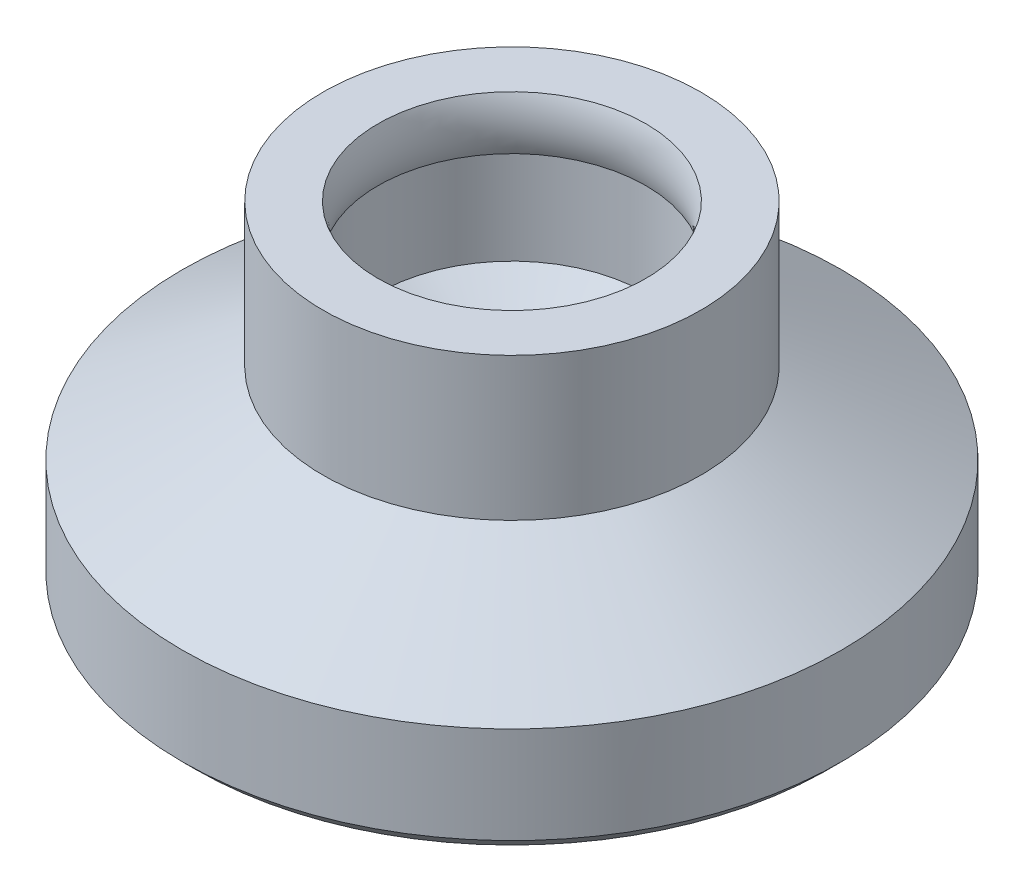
ISO-10303-21;
HEADER;
FILE_DESCRIPTION(('STEP AP214'),'2;1');
FILE_NAME('part.step','',(''),(''),'','','');
FILE_SCHEMA(('AUTOMOTIVE_DESIGN { 1 0 10303 214 1 1 1 1 }'));
ENDSEC;
DATA;
#1=APPLICATION_CONTEXT('core data for automotive mechanical design processes');
#2=APPLICATION_PROTOCOL_DEFINITION('international standard','automotive_design',2000,#1);
#3=PRODUCT_CONTEXT('',#1,'mechanical');
#4=PRODUCT('Part','Part','',(#3));
#5=PRODUCT_RELATED_PRODUCT_CATEGORY('part','',(#4));
#6=PRODUCT_DEFINITION_FORMATION('','',#4);
#7=PRODUCT_DEFINITION_CONTEXT('part definition',#1,'design');
#8=PRODUCT_DEFINITION('design','',#6,#7);
#9=PRODUCT_DEFINITION_SHAPE('','',#8);
#10=(LENGTH_UNIT() NAMED_UNIT(*) SI_UNIT(.MILLI.,.METRE.));
#11=(NAMED_UNIT(*) PLANE_ANGLE_UNIT() SI_UNIT($,.RADIAN.));
#12=(NAMED_UNIT(*) SI_UNIT($,.STERADIAN.) SOLID_ANGLE_UNIT());
#13=UNCERTAINTY_MEASURE_WITH_UNIT(LENGTH_MEASURE(1.E-05),#10,'distance_accuracy_value','');
#14=(GEOMETRIC_REPRESENTATION_CONTEXT(3) GLOBAL_UNCERTAINTY_ASSIGNED_CONTEXT((#13)) GLOBAL_UNIT_ASSIGNED_CONTEXT((#10,
#11,#12)) REPRESENTATION_CONTEXT('',''));
#15=CARTESIAN_POINT('',(0.,0.,0.));
#16=DIRECTION('',(0.,0.,1.));
#17=DIRECTION('',(1.,0.,0.));
#18=AXIS2_PLACEMENT_3D('',#15,#16,#17);
#19=CARTESIAN_POINT('',(0.,3.8,0.));
#20=DIRECTION('',(0.,-1.,0.));
#21=DIRECTION('',(0.,0.,-1.));
#22=AXIS2_PLACEMENT_3D('',#19,#20,#21);
#23=CYLINDRICAL_SURFACE('',#22,4.3);
#24=CARTESIAN_POINT('',(0.,0.547520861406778,0.));
#25=DIRECTION('',(0.,1.,0.));
#26=DIRECTION('',(0.,0.,1.));
#27=AXIS2_PLACEMENT_3D('',#24,#25,#26);
#28=CIRCLE('',#27,4.3);
#29=CARTESIAN_POINT('',(0.,0.547520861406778,-4.3));
#30=VERTEX_POINT('',#29);
#31=EDGE_CURVE('E91',#30,#30,#28,.T.);
#32=CARTESIAN_POINT('',(0.,3.8,0.));
#33=DIRECTION('',(0.,1.,0.));
#34=DIRECTION('',(0.,0.,1.));
#35=AXIS2_PLACEMENT_3D('',#32,#33,#34);
#36=CIRCLE('',#35,4.3);
#37=CARTESIAN_POINT('',(0.,3.8,-4.3));
#38=VERTEX_POINT('',#37);
#39=EDGE_CURVE('E93',#38,#38,#36,.T.);
#40=CARTESIAN_POINT('',(0.,0.547520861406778,-4.3));
#41=CARTESIAN_POINT('',(0.,0.58140085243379,-4.3));
#42=CARTESIAN_POINT('',(0.,0.615280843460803,-4.3));
#43=CARTESIAN_POINT('',(0.,0.683040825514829,-4.3));
#44=CARTESIAN_POINT('',(0.,0.716920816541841,-4.3));
#45=CARTESIAN_POINT('',(0.,0.784680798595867,-4.3));
#46=CARTESIAN_POINT('',(0.,0.818560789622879,-4.3));
#47=CARTESIAN_POINT('',(0.,0.886320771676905,-4.3));
#48=CARTESIAN_POINT('',(0.,0.920200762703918,-4.3));
#49=CARTESIAN_POINT('',(0.,0.987960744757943,-4.3));
#50=CARTESIAN_POINT('',(0.,1.02184073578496,-4.3));
#51=CARTESIAN_POINT('',(0.,1.08960071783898,-4.3));
#52=CARTESIAN_POINT('',(0.,1.12348070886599,-4.3));
#53=CARTESIAN_POINT('',(0.,1.19124069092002,-4.3));
#54=CARTESIAN_POINT('',(0.,1.22512068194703,-4.3));
#55=CARTESIAN_POINT('',(0.,1.29288066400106,-4.3));
#56=CARTESIAN_POINT('',(0.,1.32676065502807,-4.3));
#57=CARTESIAN_POINT('',(0.,1.3945206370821,-4.3));
#58=CARTESIAN_POINT('',(0.,1.42840062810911,-4.3));
#59=CARTESIAN_POINT('',(0.,1.49616061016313,-4.3));
#60=CARTESIAN_POINT('',(0.,1.53004060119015,-4.3));
#61=CARTESIAN_POINT('',(0.,1.59780058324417,-4.3));
#62=CARTESIAN_POINT('',(0.,1.63168057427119,-4.3));
#63=CARTESIAN_POINT('',(0.,1.69944055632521,-4.3));
#64=CARTESIAN_POINT('',(0.,1.73332054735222,-4.3));
#65=CARTESIAN_POINT('',(0.,1.80108052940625,-4.3));
#66=CARTESIAN_POINT('',(0.,1.83496052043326,-4.3));
#67=CARTESIAN_POINT('',(0.,1.90272050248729,-4.3));
#68=CARTESIAN_POINT('',(0.,1.9366004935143,-4.3));
#69=CARTESIAN_POINT('',(0.,2.00436047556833,-4.3));
#70=CARTESIAN_POINT('',(0.,2.03824046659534,-4.3));
#71=CARTESIAN_POINT('',(0.,2.10600044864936,-4.3));
#72=CARTESIAN_POINT('',(0.,2.13988043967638,-4.3));
#73=CARTESIAN_POINT('',(0.,2.2076404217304,-4.3));
#74=CARTESIAN_POINT('',(0.,2.24152041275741,-4.3));
#75=CARTESIAN_POINT('',(0.,2.30928039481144,-4.3));
#76=CARTESIAN_POINT('',(0.,2.34316038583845,-4.3));
#77=CARTESIAN_POINT('',(0.,2.41092036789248,-4.3));
#78=CARTESIAN_POINT('',(0.,2.44480035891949,-4.3));
#79=CARTESIAN_POINT('',(0.,2.51256034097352,-4.3));
#80=CARTESIAN_POINT('',(0.,2.54644033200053,-4.3));
#81=CARTESIAN_POINT('',(0.,2.61420031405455,-4.3));
#82=CARTESIAN_POINT('',(0.,2.64808030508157,-4.3));
#83=CARTESIAN_POINT('',(0.,2.71584028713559,-4.3));
#84=CARTESIAN_POINT('',(0.,2.74972027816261,-4.3));
#85=CARTESIAN_POINT('',(0.,2.81748026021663,-4.3));
#86=CARTESIAN_POINT('',(0.,2.85136025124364,-4.3));
#87=CARTESIAN_POINT('',(0.,2.91912023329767,-4.3));
#88=CARTESIAN_POINT('',(0.,2.95300022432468,-4.3));
#89=CARTESIAN_POINT('',(0.,3.02076020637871,-4.3));
#90=CARTESIAN_POINT('',(0.,3.05464019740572,-4.3));
#91=CARTESIAN_POINT('',(0.,3.12240017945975,-4.3));
#92=CARTESIAN_POINT('',(0.,3.15628017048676,-4.3));
#93=CARTESIAN_POINT('',(0.,3.22404015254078,-4.3));
#94=CARTESIAN_POINT('',(0.,3.2579201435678,-4.3));
#95=CARTESIAN_POINT('',(0.,3.32568012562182,-4.3));
#96=CARTESIAN_POINT('',(0.,3.35956011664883,-4.3));
#97=CARTESIAN_POINT('',(0.,3.42732009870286,-4.3));
#98=CARTESIAN_POINT('',(0.,3.46120008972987,-4.3));
#99=CARTESIAN_POINT('',(0.,3.5289600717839,-4.3));
#100=CARTESIAN_POINT('',(0.,3.56284006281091,-4.3));
#101=CARTESIAN_POINT('',(0.,3.63060004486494,-4.3));
#102=CARTESIAN_POINT('',(0.,3.66448003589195,-4.3));
#103=CARTESIAN_POINT('',(0.,3.73224001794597,-4.3));
#104=CARTESIAN_POINT('',(0.,3.76612000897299,-4.3));
#105=CARTESIAN_POINT('',(0.,3.8,-4.3));
#106=B_SPLINE_CURVE_WITH_KNOTS('',3,(#40,#41,#42,#43,#44,#45,#46,#47,#48,#49,#50,#51,#52,#53,
#54,#55,#56,#57,#58,#59,#60,#61,#62,#63,#64,#65,#66,#67,#68,#69,#70,#71,#72,#73,#74,#75,#76,#77,
#78,#79,#80,#81,#82,#83,#84,#85,#86,#87,#88,#89,#90,#91,#92,#93,#94,#95,#96,#97,#98,#99,#100,
#101,#102,#103,#104,#105),.UNSPECIFIED.,.F.,.F.,(4,2,2,2,2,2,2,2,2,2,2,2,2,2,2,2,2,2,2,2,2,2,2,
2,2,2,2,2,2,2,2,2,4),(0.,0.101639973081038,0.203279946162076,0.304919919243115,
0.406559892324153,0.508199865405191,0.609839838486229,0.711479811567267,0.813119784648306,
0.914759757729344,1.01639973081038,1.11803970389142,1.21967967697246,1.3213196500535,
1.42295962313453,1.52459959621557,1.62623956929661,1.72787954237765,1.82951951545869,
1.93115948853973,2.03279946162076,2.1344394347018,2.23607940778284,2.33771938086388,
2.43935935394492,2.54099932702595,2.64263930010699,2.74427927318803,2.84591924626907,
2.94755921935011,3.04919919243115,3.15083916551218,3.25247913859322),.UNSPECIFIED.);
#107=EDGE_CURVE('BSEAM37',#30,#38,#106,.T.);
#108=ORIENTED_EDGE('',*,*,#31,.T.);
#109=ORIENTED_EDGE('',*,*,#39,.F.);
#110=ORIENTED_EDGE('',*,*,#107,.T.);
#111=ORIENTED_EDGE('',*,*,#107,.F.);
#112=EDGE_LOOP('',(#108,#110,#109,#111));
#113=FACE_BOUND('',#112,.T.);
#114=ADVANCED_FACE('F37',(#113),#23,.T.);
#115=CARTESIAN_POINT('',(0.,3.8,0.));
#116=DIRECTION('',(0.,1.,0.));
#117=DIRECTION('',(0.,0.,1.));
#118=AXIS2_PLACEMENT_3D('',#115,#116,#117);
#119=PLANE('',#118);
#120=CARTESIAN_POINT('',(0.,3.8,0.));
#121=DIRECTION('',(0.,-1.,0.));
#122=DIRECTION('',(0.,0.,-1.));
#123=AXIS2_PLACEMENT_3D('',#120,#121,#122);
#124=CIRCLE('',#123,3.05);
#125=CARTESIAN_POINT('',(0.,3.8,-3.05));
#126=VERTEX_POINT('',#125);
#127=EDGE_CURVE('E108',#126,#126,#124,.T.);
#128=ORIENTED_EDGE('',*,*,#127,.T.);
#129=EDGE_LOOP('',(#128));
#130=FACE_BOUND('',#129,.T.);
#131=ORIENTED_EDGE('',*,*,#39,.T.);
#132=EDGE_LOOP('',(#131));
#133=FACE_BOUND('',#132,.T.);
#134=ADVANCED_FACE('F65',(#130,#133),#119,.T.);
#135=CARTESIAN_POINT('',(0.,0.547520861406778,0.));
#136=DIRECTION('',(0.,-1.,0.));
#137=DIRECTION('',(0.,0.,-1.));
#138=AXIS2_PLACEMENT_3D('',#135,#136,#137);
#139=CONICAL_SURFACE('',#138,4.3,1.0471975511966);
#140=CARTESIAN_POINT('',(0.,-1.3,0.));
#141=DIRECTION('',(0.,1.,0.));
#142=DIRECTION('',(0.,0.,1.));
#143=AXIS2_PLACEMENT_3D('',#140,#141,#142);
#144=CIRCLE('',#143,7.5);
#145=CARTESIAN_POINT('',(0.,-1.3,7.5));
#146=VERTEX_POINT('',#145);
#147=EDGE_CURVE('E89',#146,#146,#144,.T.);
#148=ORIENTED_EDGE('',*,*,#147,.T.);
#149=EDGE_LOOP('',(#148));
#150=FACE_BOUND('',#149,.T.);
#151=ORIENTED_EDGE('',*,*,#31,.F.);
#152=EDGE_LOOP('',(#151));
#153=FACE_BOUND('',#152,.T.);
#154=ADVANCED_FACE('F70',(#150,#153),#139,.T.);
#155=CARTESIAN_POINT('',(0.,-3.8,0.));
#156=DIRECTION('',(0.,1.,0.));
#157=DIRECTION('',(0.,0.,1.));
#158=AXIS2_PLACEMENT_3D('',#155,#156,#157);
#159=PLANE('',#158);
#160=CARTESIAN_POINT('',(0.,-3.8,0.));
#161=DIRECTION('',(0.,1.,0.));
#162=DIRECTION('',(0.,0.,1.));
#163=AXIS2_PLACEMENT_3D('',#160,#161,#162);
#164=CIRCLE('',#163,7.2);
#165=CARTESIAN_POINT('',(0.,-3.8,7.2));
#166=VERTEX_POINT('',#165);
#167=EDGE_CURVE('E45',#166,#166,#164,.F.);
#168=ORIENTED_EDGE('',*,*,#167,.T.);
#169=EDGE_LOOP('',(#168));
#170=FACE_BOUND('',#169,.T.);
#171=ADVANCED_FACE('F76',(#170),#159,.F.);
#172=CARTESIAN_POINT('',(0.,-1.3,0.));
#173=DIRECTION('',(0.,-1.,0.));
#174=DIRECTION('',(0.,0.,-1.));
#175=AXIS2_PLACEMENT_3D('',#172,#173,#174);
#176=CYLINDRICAL_SURFACE('',#175,7.5);
#177=CARTESIAN_POINT('',(0.,-3.5,0.));
#178=DIRECTION('',(0.,1.,0.));
#179=DIRECTION('',(0.,0.,1.));
#180=AXIS2_PLACEMENT_3D('',#177,#178,#179);
#181=CIRCLE('',#180,7.5);
#182=CARTESIAN_POINT('',(0.,-3.5,7.5));
#183=VERTEX_POINT('',#182);
#184=EDGE_CURVE('E11',#183,#183,#181,.T.);
#185=ORIENTED_EDGE('',*,*,#184,.T.);
#186=EDGE_LOOP('',(#185));
#187=FACE_BOUND('',#186,.T.);
#188=ORIENTED_EDGE('',*,*,#147,.F.);
#189=EDGE_LOOP('',(#188));
#190=FACE_BOUND('',#189,.T.);
#191=ADVANCED_FACE('F60',(#187,#190),#176,.T.);
#192=CARTESIAN_POINT('',(0.,-3.8,0.));
#193=DIRECTION('',(0.,1.,0.));
#194=DIRECTION('',(0.,0.,1.));
#195=AXIS2_PLACEMENT_3D('',#192,#193,#194);
#196=CONICAL_SURFACE('',#195,7.2,0.78539816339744);
#197=ORIENTED_EDGE('',*,*,#184,.F.);
#198=EDGE_LOOP('',(#197));
#199=FACE_BOUND('',#198,.T.);
#200=ORIENTED_EDGE('',*,*,#167,.F.);
#201=EDGE_LOOP('',(#200));
#202=FACE_BOUND('',#201,.T.);
#203=ADVANCED_FACE('F39',(#199,#202),#196,.T.);
#204=CARTESIAN_POINT('',(0.,-1.3,0.));
#205=DIRECTION('',(0.,1.,0.));
#206=DIRECTION('',(0.,0.,1.));
#207=AXIS2_PLACEMENT_3D('',#204,#205,#206);
#208=CONICAL_SURFACE('',#207,0.,1.04719755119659);
#209=CARTESIAN_POINT('',(0.,0.460918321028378,0.));
#210=DIRECTION('',(0.,-1.,0.));
#211=DIRECTION('',(0.,0.,-1.));
#212=AXIS2_PLACEMENT_3D('',#209,#210,#211);
#213=CIRCLE('',#212,3.05);
#214=CARTESIAN_POINT('',(0.,0.460918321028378,-3.05));
#215=VERTEX_POINT('',#214);
#216=EDGE_CURVE('E100',#215,#215,#213,.T.);
#217=ORIENTED_EDGE('',*,*,#216,.F.);
#218=EDGE_LOOP('',(#217));
#219=FACE_BOUND('',#218,.T.);
#220=CARTESIAN_POINT('',(0.,-1.3,0.));
#221=VERTEX_POINT('',#220);
#222=VERTEX_LOOP('',#221);
#223=FACE_BOUND('',#222,.T.);
#224=ADVANCED_FACE('F48',(#219,#223),#208,.F.);
#225=CARTESIAN_POINT('',(0.,0.,0.));
#226=DIRECTION('',(0.,-1.,0.));
#227=DIRECTION('',(0.,0.,-1.));
#228=AXIS2_PLACEMENT_3D('',#225,#226,#227);
#229=CYLINDRICAL_SURFACE('',#228,3.05);
#230=CARTESIAN_POINT('',(0.,2.58,0.));
#231=DIRECTION('',(0.,-1.,0.));
#232=DIRECTION('',(0.,0.,-1.));
#233=AXIS2_PLACEMENT_3D('',#230,#231,#232);
#234=CIRCLE('',#233,3.05);
#235=CARTESIAN_POINT('',(0.,2.58,-3.05));
#236=VERTEX_POINT('',#235);
#237=EDGE_CURVE('E111',#236,#236,#234,.T.);
#238=ORIENTED_EDGE('',*,*,#237,.F.);
#239=EDGE_LOOP('',(#238));
#240=FACE_BOUND('',#239,.T.);
#241=ORIENTED_EDGE('',*,*,#216,.T.);
#242=EDGE_LOOP('',(#241));
#243=FACE_BOUND('',#242,.T.);
#244=ADVANCED_FACE('F50',(#240,#243),#229,.F.);
#245=CARTESIAN_POINT('',(0.,3.19,0.));
#246=DIRECTION('',(0.,-1.,0.));
#247=DIRECTION('',(0.,0.,-1.));
#248=AXIS2_PLACEMENT_3D('',#245,#246,#247);
#249=TOROIDAL_SURFACE('',#248,4.514,1.586);
#250=ORIENTED_EDGE('',*,*,#127,.F.);
#251=EDGE_LOOP('',(#250));
#252=FACE_BOUND('',#251,.T.);
#253=ORIENTED_EDGE('',*,*,#237,.T.);
#254=EDGE_LOOP('',(#253));
#255=FACE_BOUND('',#254,.T.);
#256=ADVANCED_FACE('F57',(#252,#255),#249,.T.);
#257=CLOSED_SHELL('',(#114,#134,#154,#171,#191,#203,#224,#244,#256));
#258=MANIFOLD_SOLID_BREP('B2',#257);
#259=ADVANCED_BREP_SHAPE_REPRESENTATION('',(#18,#258),#14);
#260=SHAPE_DEFINITION_REPRESENTATION(#9,#259);
ENDSEC;
END-ISO-10303-21;
